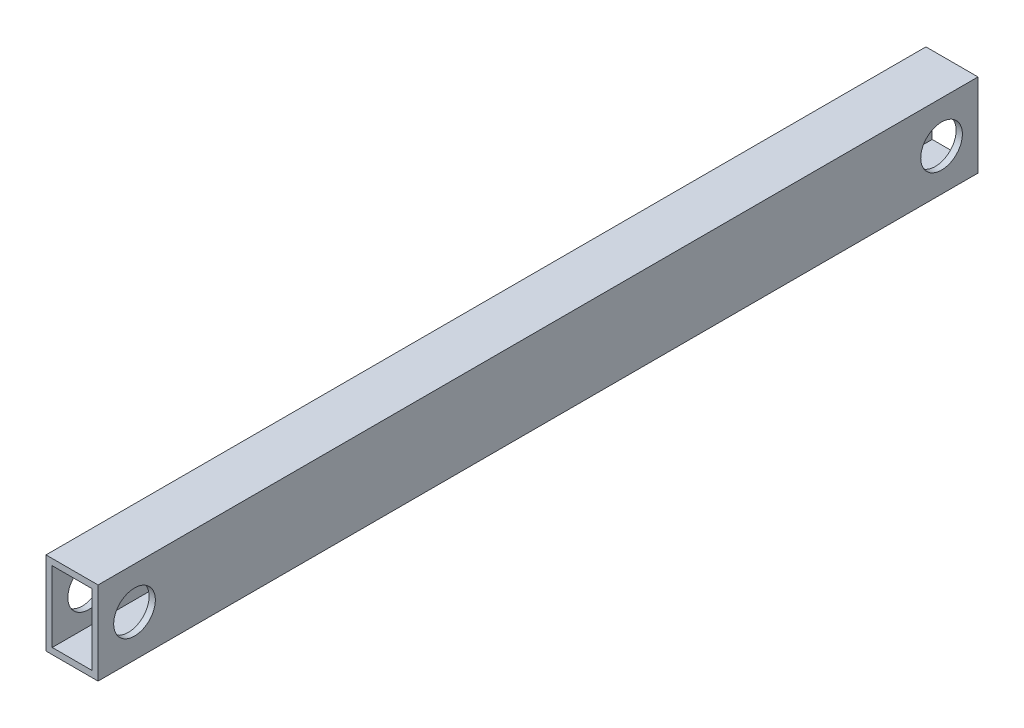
from build123d import *

# Parameters (mm, degrees)
ESQUISSE1_W             = 50
ESQUISSE1_H             = 80
ESQUISSE1_W_2           = 38
ESQUISSE1_H_2           = 68
EXTRU_MINCE1_DEPTH      = 845
ESQUISSE2_R             = 20
ENL_V_MAT_EXTRU_1_DEPTH = 851.249963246


with BuildPart() as part:
    # Esquisse1 → Extru.-Mince1 (new body)
    with BuildSketch(Plane.XY):
        with Locations((25, -40)):
            Rectangle(ESQUISSE1_W, ESQUISSE1_H)
        with Locations((25, -40)):
            Rectangle(ESQUISSE1_W_2, ESQUISSE1_H_2, mode=Mode.SUBTRACT)
    extrude(amount=EXTRU_MINCE1_DEPTH)

    # Esquisse2 → Enl_v. mat.-Extru.1 (cut, through all)
    with BuildSketch(Plane(origin=(50, 0, 0), x_dir=(0, 0, -1), z_dir=(1, 0, 0))):
        with Locations(Location((-810, -40, 0), (0, 0, 90))):
            Circle(ESQUISSE2_R)
        with Locations(Location((-35, -40, 0), (0, 0, 90))):
            Circle(ESQUISSE2_R)
    extrude(amount=-ENL_V_MAT_EXTRU_1_DEPTH, mode=Mode.SUBTRACT)


solid = part.part
